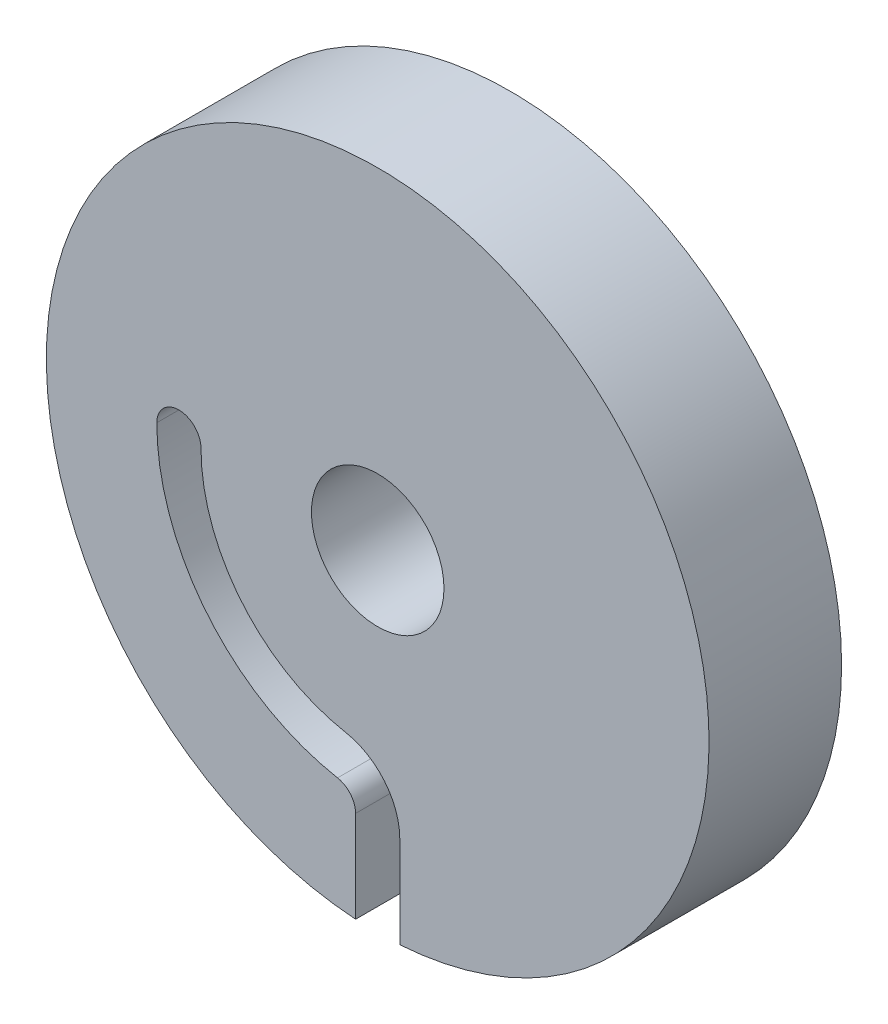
ISO-10303-21;
HEADER;
FILE_DESCRIPTION(('STEP AP214'),'2;1');
FILE_NAME('part.step','',(''),(''),'','','');
FILE_SCHEMA(('AUTOMOTIVE_DESIGN { 1 0 10303 214 1 1 1 1 }'));
ENDSEC;
DATA;
#1=APPLICATION_CONTEXT('core data for automotive mechanical design processes');
#2=APPLICATION_PROTOCOL_DEFINITION('international standard','automotive_design',2000,#1);
#3=PRODUCT_CONTEXT('',#1,'mechanical');
#4=PRODUCT('Part','Part','',(#3));
#5=PRODUCT_RELATED_PRODUCT_CATEGORY('part','',(#4));
#6=PRODUCT_DEFINITION_FORMATION('','',#4);
#7=PRODUCT_DEFINITION_CONTEXT('part definition',#1,'design');
#8=PRODUCT_DEFINITION('design','',#6,#7);
#9=PRODUCT_DEFINITION_SHAPE('','',#8);
#10=(LENGTH_UNIT() NAMED_UNIT(*) SI_UNIT(.MILLI.,.METRE.));
#11=(NAMED_UNIT(*) PLANE_ANGLE_UNIT() SI_UNIT($,.RADIAN.));
#12=(NAMED_UNIT(*) SI_UNIT($,.STERADIAN.) SOLID_ANGLE_UNIT());
#13=UNCERTAINTY_MEASURE_WITH_UNIT(LENGTH_MEASURE(1.E-05),#10,'distance_accuracy_value','');
#14=(GEOMETRIC_REPRESENTATION_CONTEXT(3) GLOBAL_UNCERTAINTY_ASSIGNED_CONTEXT((#13)) GLOBAL_UNIT_ASSIGNED_CONTEXT((#10,
#11,#12)) REPRESENTATION_CONTEXT('',''));
#15=CARTESIAN_POINT('',(0.,0.,0.));
#16=DIRECTION('',(0.,0.,1.));
#17=DIRECTION('',(1.,0.,0.));
#18=AXIS2_PLACEMENT_3D('',#15,#16,#17);
#19=CARTESIAN_POINT('',(0.,0.,6.));
#20=DIRECTION('',(0.,0.,1.));
#21=DIRECTION('',(1.,0.,0.));
#22=AXIS2_PLACEMENT_3D('',#19,#20,#21);
#23=PLANE('',#22);
#24=DIRECTION('',(0.,1.,0.));
#25=VECTOR('',#24,1.);
#26=CARTESIAN_POINT('',(1.,-15.5632343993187,6.));
#27=LINE('',#26,#25);
#28=CARTESIAN_POINT('',(1.,-14.9666295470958,6.));
#29=VERTEX_POINT('',#28);
#30=CARTESIAN_POINT('',(1.,-10.816653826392,6.));
#31=VERTEX_POINT('',#30);
#32=EDGE_CURVE('E123',#29,#31,#27,.T.);
#33=ORIENTED_EDGE('',*,*,#32,.F.);
#34=CARTESIAN_POINT('',(0.,0.,6.));
#35=DIRECTION('',(0.,0.,1.));
#36=DIRECTION('',(1.,0.,0.));
#37=AXIS2_PLACEMENT_3D('',#34,#35,#36);
#38=CIRCLE('',#37,15.);
#39=CARTESIAN_POINT('',(-0.999999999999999,-14.9666295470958,6.));
#40=VERTEX_POINT('',#39);
#41=EDGE_CURVE('E161',#29,#40,#38,.T.);
#42=ORIENTED_EDGE('',*,*,#41,.T.);
#43=DIRECTION('',(0.,-1.,0.));
#44=VECTOR('',#43,1.);
#45=CARTESIAN_POINT('',(-0.999999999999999,-10.816653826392,6.));
#46=LINE('',#45,#44);
#47=CARTESIAN_POINT('',(-0.999999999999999,-10.816653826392,6.));
#48=VERTEX_POINT('',#47);
#49=EDGE_CURVE('E119',#48,#40,#46,.T.);
#50=ORIENTED_EDGE('',*,*,#49,.F.);
#51=CARTESIAN_POINT('',(-2.,-10.816653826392,6.));
#52=DIRECTION('',(0.,0.,-1.));
#53=DIRECTION('',(-1.,0.,0.));
#54=AXIS2_PLACEMENT_3D('',#51,#52,#53);
#55=CIRCLE('',#54,1.);
#56=CARTESIAN_POINT('',(-1.81818181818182,-9.83332166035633,6.));
#57=VERTEX_POINT('',#56);
#58=EDGE_CURVE('E117',#57,#48,#55,.T.);
#59=ORIENTED_EDGE('',*,*,#58,.F.);
#60=CARTESIAN_POINT('',(0.,0.,6.));
#61=DIRECTION('',(0.,0.,1.));
#62=DIRECTION('',(1.,0.,0.));
#63=AXIS2_PLACEMENT_3D('',#60,#61,#62);
#64=CIRCLE('',#63,10.);
#65=CARTESIAN_POINT('',(-10.,0.,6.));
#66=VERTEX_POINT('',#65);
#67=EDGE_CURVE('E95',#66,#57,#64,.T.);
#68=ORIENTED_EDGE('',*,*,#67,.F.);
#69=CARTESIAN_POINT('',(-9.,0.,6.));
#70=DIRECTION('',(0.,0.,1.));
#71=DIRECTION('',(-1.,0.,0.));
#72=AXIS2_PLACEMENT_3D('',#69,#70,#71);
#73=CIRCLE('',#72,0.999999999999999);
#74=CARTESIAN_POINT('',(-8.,0.,6.));
#75=VERTEX_POINT('',#74);
#76=EDGE_CURVE('E106',#75,#66,#73,.T.);
#77=ORIENTED_EDGE('',*,*,#76,.F.);
#78=CARTESIAN_POINT('',(0.,0.,6.));
#79=DIRECTION('',(0.,0.,-1.));
#80=DIRECTION('',(1.,0.,0.));
#81=AXIS2_PLACEMENT_3D('',#78,#79,#80);
#82=CIRCLE('',#81,8.);
#83=CARTESIAN_POINT('',(-1.45454545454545,-7.86665732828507,6.));
#84=VERTEX_POINT('',#83);
#85=EDGE_CURVE('E128',#84,#75,#82,.T.);
#86=ORIENTED_EDGE('',*,*,#85,.F.);
#87=CARTESIAN_POINT('',(-2.,-10.816653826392,6.));
#88=DIRECTION('',(0.,0.,1.));
#89=DIRECTION('',(1.,0.,0.));
#90=AXIS2_PLACEMENT_3D('',#87,#88,#89);
#91=CIRCLE('',#90,3.);
#92=EDGE_CURVE('E125',#31,#84,#91,.T.);
#93=ORIENTED_EDGE('',*,*,#92,.F.);
#94=EDGE_LOOP('',(#33,#42,#50,#59,#68,#77,#86,#93));
#95=FACE_BOUND('',#94,.T.);
#96=CARTESIAN_POINT('',(0.,0.,6.));
#97=DIRECTION('',(0.,0.,1.));
#98=DIRECTION('',(1.,0.,0.));
#99=AXIS2_PLACEMENT_3D('',#96,#97,#98);
#100=CIRCLE('',#99,3.);
#101=CARTESIAN_POINT('',(3.,0.,6.));
#102=VERTEX_POINT('',#101);
#103=EDGE_CURVE('E155',#102,#102,#100,.T.);
#104=ORIENTED_EDGE('',*,*,#103,.F.);
#105=EDGE_LOOP('',(#104));
#106=FACE_BOUND('',#105,.T.);
#107=ADVANCED_FACE('F26',(#95,#106),#23,.T.);
#108=CARTESIAN_POINT('',(0.,0.,0.));
#109=DIRECTION('',(0.,0.,1.));
#110=DIRECTION('',(1.,0.,0.));
#111=AXIS2_PLACEMENT_3D('',#108,#109,#110);
#112=PLANE('',#111);
#113=CARTESIAN_POINT('',(0.,0.,0.));
#114=DIRECTION('',(0.,0.,1.));
#115=DIRECTION('',(1.,0.,0.));
#116=AXIS2_PLACEMENT_3D('',#113,#114,#115);
#117=CIRCLE('',#116,15.);
#118=CARTESIAN_POINT('',(15.,0.,0.));
#119=VERTEX_POINT('',#118);
#120=EDGE_CURVE('E158',#119,#119,#117,.T.);
#121=ORIENTED_EDGE('',*,*,#120,.F.);
#122=EDGE_LOOP('',(#121));
#123=FACE_BOUND('',#122,.T.);
#124=CARTESIAN_POINT('',(0.,0.,0.));
#125=DIRECTION('',(0.,0.,1.));
#126=DIRECTION('',(1.,0.,0.));
#127=AXIS2_PLACEMENT_3D('',#124,#125,#126);
#128=CIRCLE('',#127,3.);
#129=CARTESIAN_POINT('',(3.,0.,0.));
#130=VERTEX_POINT('',#129);
#131=EDGE_CURVE('E144',#130,#130,#128,.T.);
#132=ORIENTED_EDGE('',*,*,#131,.T.);
#133=EDGE_LOOP('',(#132));
#134=FACE_BOUND('',#133,.T.);
#135=ADVANCED_FACE('F195',(#123,#134),#112,.F.);
#136=CARTESIAN_POINT('',(0.,0.,6.));
#137=DIRECTION('',(0.,0.,-1.));
#138=DIRECTION('',(-1.,0.,0.));
#139=AXIS2_PLACEMENT_3D('',#136,#137,#138);
#140=CYLINDRICAL_SURFACE('',#139,15.);
#141=ORIENTED_EDGE('',*,*,#41,.F.);
#142=DIRECTION('',(0.,0.,-1.));
#143=VECTOR('',#142,1.);
#144=CARTESIAN_POINT('',(1.,-14.9666295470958,6.));
#145=LINE('',#144,#143);
#146=CARTESIAN_POINT('',(1.,-14.9666295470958,3.7));
#147=VERTEX_POINT('',#146);
#148=EDGE_CURVE('E11',#29,#147,#145,.T.);
#149=ORIENTED_EDGE('',*,*,#148,.T.);
#150=CARTESIAN_POINT('',(0.,0.,3.7));
#151=DIRECTION('',(0.,0.,-1.));
#152=DIRECTION('',(-1.,0.,0.));
#153=AXIS2_PLACEMENT_3D('',#150,#151,#152);
#154=CIRCLE('',#153,15.);
#155=CARTESIAN_POINT('',(-0.999999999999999,-14.9666295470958,3.7));
#156=VERTEX_POINT('',#155);
#157=EDGE_CURVE('E46',#147,#156,#154,.T.);
#158=ORIENTED_EDGE('',*,*,#157,.T.);
#159=DIRECTION('',(0.,0.,-1.));
#160=VECTOR('',#159,1.);
#161=CARTESIAN_POINT('',(-0.999999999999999,-14.9666295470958,6.));
#162=LINE('',#161,#160);
#163=EDGE_CURVE('E34',#156,#40,#162,.F.);
#164=ORIENTED_EDGE('',*,*,#163,.T.);
#165=EDGE_LOOP('',(#141,#149,#158,#164));
#166=FACE_BOUND('',#165,.T.);
#167=ORIENTED_EDGE('',*,*,#120,.T.);
#168=EDGE_LOOP('',(#167));
#169=FACE_BOUND('',#168,.T.);
#170=ADVANCED_FACE('F28',(#166,#169),#140,.T.);
#171=CARTESIAN_POINT('',(0.,0.,6.));
#172=DIRECTION('',(0.,0.,-1.));
#173=DIRECTION('',(-1.,0.,0.));
#174=AXIS2_PLACEMENT_3D('',#171,#172,#173);
#175=CYLINDRICAL_SURFACE('',#174,3.);
#176=ORIENTED_EDGE('',*,*,#103,.T.);
#177=EDGE_LOOP('',(#176));
#178=FACE_BOUND('',#177,.T.);
#179=ORIENTED_EDGE('',*,*,#131,.F.);
#180=EDGE_LOOP('',(#179));
#181=FACE_BOUND('',#180,.T.);
#182=ADVANCED_FACE('F191',(#178,#181),#175,.F.);
#183=CARTESIAN_POINT('',(1.,-15.5632343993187,3.7));
#184=DIRECTION('',(1.,0.,0.));
#185=DIRECTION('',(0.,0.,-1.));
#186=AXIS2_PLACEMENT_3D('',#183,#184,#185);
#187=PLANE('',#186);
#188=ORIENTED_EDGE('',*,*,#32,.T.);
#189=DIRECTION('',(0.,0.,1.));
#190=VECTOR('',#189,1.);
#191=CARTESIAN_POINT('',(1.,-10.816653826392,3.7));
#192=LINE('',#191,#190);
#193=CARTESIAN_POINT('',(1.,-10.816653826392,3.7));
#194=VERTEX_POINT('',#193);
#195=EDGE_CURVE('E147',#194,#31,#192,.T.);
#196=ORIENTED_EDGE('',*,*,#195,.F.);
#197=DIRECTION('',(0.,1.,0.));
#198=VECTOR('',#197,1.);
#199=CARTESIAN_POINT('',(1.,-15.5632343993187,3.7));
#200=LINE('',#199,#198);
#201=EDGE_CURVE('E136',#147,#194,#200,.T.);
#202=ORIENTED_EDGE('',*,*,#201,.F.);
#203=ORIENTED_EDGE('',*,*,#148,.F.);
#204=EDGE_LOOP('',(#188,#196,#202,#203));
#205=FACE_BOUND('',#204,.T.);
#206=ADVANCED_FACE('F172',(#205),#187,.F.);
#207=CARTESIAN_POINT('',(-0.999999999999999,-10.816653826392,3.7));
#208=DIRECTION('',(-1.,0.,0.));
#209=DIRECTION('',(0.,-1.,0.));
#210=AXIS2_PLACEMENT_3D('',#207,#208,#209);
#211=PLANE('',#210);
#212=DIRECTION('',(0.,-1.,0.));
#213=VECTOR('',#212,1.);
#214=CARTESIAN_POINT('',(-0.999999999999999,-10.816653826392,3.7));
#215=LINE('',#214,#213);
#216=CARTESIAN_POINT('',(-0.999999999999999,-10.816653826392,3.7));
#217=VERTEX_POINT('',#216);
#218=EDGE_CURVE('E41',#217,#156,#215,.T.);
#219=ORIENTED_EDGE('',*,*,#218,.F.);
#220=DIRECTION('',(0.,0.,1.));
#221=VECTOR('',#220,1.);
#222=CARTESIAN_POINT('',(-0.999999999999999,-10.816653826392,3.7));
#223=LINE('',#222,#221);
#224=EDGE_CURVE('E150',#217,#48,#223,.T.);
#225=ORIENTED_EDGE('',*,*,#224,.T.);
#226=ORIENTED_EDGE('',*,*,#49,.T.);
#227=ORIENTED_EDGE('',*,*,#163,.F.);
#228=EDGE_LOOP('',(#219,#225,#226,#227));
#229=FACE_BOUND('',#228,.T.);
#230=ADVANCED_FACE('F183',(#229),#211,.F.);
#231=CARTESIAN_POINT('',(-9.,0.,3.7));
#232=DIRECTION('',(0.,0.,-1.));
#233=DIRECTION('',(-1.,0.,0.));
#234=AXIS2_PLACEMENT_3D('',#231,#232,#233);
#235=PLANE('',#234);
#236=ORIENTED_EDGE('',*,*,#201,.T.);
#237=CARTESIAN_POINT('',(-2.,-10.816653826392,3.7));
#238=DIRECTION('',(0.,0.,1.));
#239=DIRECTION('',(1.,0.,0.));
#240=AXIS2_PLACEMENT_3D('',#237,#238,#239);
#241=CIRCLE('',#240,3.);
#242=CARTESIAN_POINT('',(-1.45454545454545,-7.86665732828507,3.7));
#243=VERTEX_POINT('',#242);
#244=EDGE_CURVE('E138',#194,#243,#241,.T.);
#245=ORIENTED_EDGE('',*,*,#244,.T.);
#246=CARTESIAN_POINT('',(0.,0.,3.7));
#247=DIRECTION('',(0.,0.,-1.));
#248=DIRECTION('',(1.,0.,0.));
#249=AXIS2_PLACEMENT_3D('',#246,#247,#248);
#250=CIRCLE('',#249,8.);
#251=CARTESIAN_POINT('',(-8.,0.,3.7));
#252=VERTEX_POINT('',#251);
#253=EDGE_CURVE('E103',#243,#252,#250,.T.);
#254=ORIENTED_EDGE('',*,*,#253,.T.);
#255=CARTESIAN_POINT('',(-9.,0.,3.7));
#256=DIRECTION('',(0.,0.,1.));
#257=DIRECTION('',(-1.,0.,0.));
#258=AXIS2_PLACEMENT_3D('',#255,#256,#257);
#259=CIRCLE('',#258,0.999999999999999);
#260=CARTESIAN_POINT('',(-10.,0.,3.7));
#261=VERTEX_POINT('',#260);
#262=EDGE_CURVE('E130',#252,#261,#259,.T.);
#263=ORIENTED_EDGE('',*,*,#262,.T.);
#264=CARTESIAN_POINT('',(0.,0.,3.7));
#265=DIRECTION('',(0.,0.,1.));
#266=DIRECTION('',(1.,0.,0.));
#267=AXIS2_PLACEMENT_3D('',#264,#265,#266);
#268=CIRCLE('',#267,10.);
#269=CARTESIAN_POINT('',(-1.81818181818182,-9.83332166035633,3.7));
#270=VERTEX_POINT('',#269);
#271=EDGE_CURVE('E98',#261,#270,#268,.T.);
#272=ORIENTED_EDGE('',*,*,#271,.T.);
#273=CARTESIAN_POINT('',(-2.,-10.816653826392,3.7));
#274=DIRECTION('',(0.,0.,-1.));
#275=DIRECTION('',(-1.,0.,0.));
#276=AXIS2_PLACEMENT_3D('',#273,#274,#275);
#277=CIRCLE('',#276,1.);
#278=EDGE_CURVE('E133',#270,#217,#277,.T.);
#279=ORIENTED_EDGE('',*,*,#278,.T.);
#280=ORIENTED_EDGE('',*,*,#218,.T.);
#281=ORIENTED_EDGE('',*,*,#157,.F.);
#282=EDGE_LOOP('',(#236,#245,#254,#263,#272,#279,#280,#281));
#283=FACE_BOUND('',#282,.T.);
#284=ADVANCED_FACE('F177',(#283),#235,.F.);
#285=CARTESIAN_POINT('',(-9.,0.,3.7));
#286=DIRECTION('',(0.,0.,1.));
#287=DIRECTION('',(1.,0.,0.));
#288=AXIS2_PLACEMENT_3D('',#285,#286,#287);
#289=CYLINDRICAL_SURFACE('',#288,0.999999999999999);
#290=ORIENTED_EDGE('',*,*,#76,.T.);
#291=DIRECTION('',(0.,0.,1.));
#292=VECTOR('',#291,1.);
#293=CARTESIAN_POINT('',(-10.,0.,3.7));
#294=LINE('',#293,#292);
#295=EDGE_CURVE('E91',#261,#66,#294,.T.);
#296=ORIENTED_EDGE('',*,*,#295,.F.);
#297=ORIENTED_EDGE('',*,*,#262,.F.);
#298=DIRECTION('',(0.,0.,1.));
#299=VECTOR('',#298,1.);
#300=CARTESIAN_POINT('',(-8.,0.,3.7));
#301=LINE('',#300,#299);
#302=EDGE_CURVE('E108',#252,#75,#301,.T.);
#303=ORIENTED_EDGE('',*,*,#302,.T.);
#304=EDGE_LOOP('',(#290,#296,#297,#303));
#305=FACE_BOUND('',#304,.T.);
#306=ADVANCED_FACE('F107',(#305),#289,.F.);
#307=CARTESIAN_POINT('',(0.,0.,3.7));
#308=DIRECTION('',(0.,0.,1.));
#309=DIRECTION('',(1.,0.,0.));
#310=AXIS2_PLACEMENT_3D('',#307,#308,#309);
#311=CYLINDRICAL_SURFACE('',#310,8.);
#312=ORIENTED_EDGE('',*,*,#85,.T.);
#313=ORIENTED_EDGE('',*,*,#302,.F.);
#314=ORIENTED_EDGE('',*,*,#253,.F.);
#315=DIRECTION('',(0.,0.,1.));
#316=VECTOR('',#315,1.);
#317=CARTESIAN_POINT('',(-1.45454545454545,-7.86665732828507,3.7));
#318=LINE('',#317,#316);
#319=EDGE_CURVE('E145',#243,#84,#318,.T.);
#320=ORIENTED_EDGE('',*,*,#319,.T.);
#321=EDGE_LOOP('',(#312,#313,#314,#320));
#322=FACE_BOUND('',#321,.T.);
#323=ADVANCED_FACE('F179',(#322),#311,.T.);
#324=CARTESIAN_POINT('',(-2.,-10.816653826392,3.7));
#325=DIRECTION('',(0.,0.,1.));
#326=DIRECTION('',(1.,0.,0.));
#327=AXIS2_PLACEMENT_3D('',#324,#325,#326);
#328=CYLINDRICAL_SURFACE('',#327,3.);
#329=ORIENTED_EDGE('',*,*,#92,.T.);
#330=ORIENTED_EDGE('',*,*,#319,.F.);
#331=ORIENTED_EDGE('',*,*,#244,.F.);
#332=ORIENTED_EDGE('',*,*,#195,.T.);
#333=EDGE_LOOP('',(#329,#330,#331,#332));
#334=FACE_BOUND('',#333,.T.);
#335=ADVANCED_FACE('F175',(#334),#328,.F.);
#336=CARTESIAN_POINT('',(-2.,-10.816653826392,3.7));
#337=DIRECTION('',(0.,0.,1.));
#338=DIRECTION('',(1.,0.,0.));
#339=AXIS2_PLACEMENT_3D('',#336,#337,#338);
#340=CYLINDRICAL_SURFACE('',#339,1.);
#341=ORIENTED_EDGE('',*,*,#58,.T.);
#342=ORIENTED_EDGE('',*,*,#224,.F.);
#343=ORIENTED_EDGE('',*,*,#278,.F.);
#344=DIRECTION('',(0.,0.,1.));
#345=VECTOR('',#344,1.);
#346=CARTESIAN_POINT('',(-1.81818181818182,-9.83332166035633,3.7));
#347=LINE('',#346,#345);
#348=EDGE_CURVE('E102',#270,#57,#347,.T.);
#349=ORIENTED_EDGE('',*,*,#348,.T.);
#350=EDGE_LOOP('',(#341,#342,#343,#349));
#351=FACE_BOUND('',#350,.T.);
#352=ADVANCED_FACE('F182',(#351),#340,.T.);
#353=CARTESIAN_POINT('',(0.,0.,3.7));
#354=DIRECTION('',(0.,0.,1.));
#355=DIRECTION('',(1.,0.,0.));
#356=AXIS2_PLACEMENT_3D('',#353,#354,#355);
#357=CYLINDRICAL_SURFACE('',#356,10.);
#358=ORIENTED_EDGE('',*,*,#67,.T.);
#359=ORIENTED_EDGE('',*,*,#348,.F.);
#360=ORIENTED_EDGE('',*,*,#271,.F.);
#361=ORIENTED_EDGE('',*,*,#295,.T.);
#362=EDGE_LOOP('',(#358,#359,#360,#361));
#363=FACE_BOUND('',#362,.T.);
#364=ADVANCED_FACE('F93',(#363),#357,.F.);
#365=CLOSED_SHELL('',(#107,#135,#170,#182,#206,#230,#284,#306,#323,#335,#352,#364));
#366=MANIFOLD_SOLID_BREP('B2',#365);
#367=ADVANCED_BREP_SHAPE_REPRESENTATION('',(#18,#366),#14);
#368=SHAPE_DEFINITION_REPRESENTATION(#9,#367);
ENDSEC;
END-ISO-10303-21;
